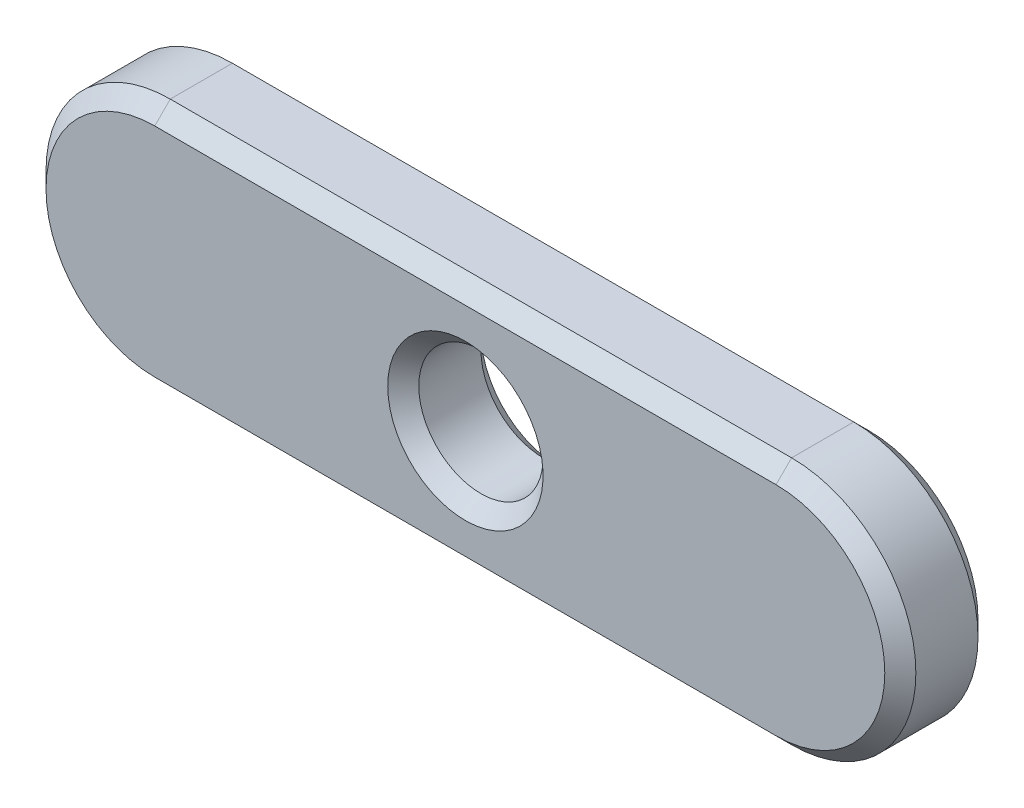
from build123d import *

# Parameters (mm, degrees)
BASE_EXTRUSION_DEPTH    = 3
ESQUISSE2_R             = 2
ENL_V_MAT_EXTRU_1_DEPTH = 3
CHANFREIN1_SIZE         = 0.5


with BuildPart() as part:
    # Esquisse1 → Base-Extrusion (new body)
    with BuildSketch(Plane.XY):
        with BuildLine():
            Line((-10, 4), (10, 4))
            ThreePointArc((10, 4), (14, 0), (10, -4))
            Line((10, -4), (-10, -4))
            ThreePointArc((-10, -4), (-14, 0), (-10, 4))
        make_face()
    extrude(amount=BASE_EXTRUSION_DEPTH)

    # Esquisse2 → Enl_v. mat.-Extru.1 (cut)
    with BuildSketch(Plane.XY.offset(3)):
        with Locations(Location((0, 0, 0), (0, 0, 180))):
            Circle(ESQUISSE2_R)
    extrude(amount=-ENL_V_MAT_EXTRU_1_DEPTH, mode=Mode.SUBTRACT)

    # Chanfrein1
    chanfrein1_edges = [part.edges().sort_by_distance(p)[0] for p in [
        (0, -4, 0),
        (0, -4, 3),
        (14, 0, 0),
        (14, 0, 3),
        (-14, 0, 0),
        (-14, 0, 3),
        (0, 4, 0),
        (2, 0, 0),
        (0, 4, 3),
        (2, 0, 3),
    ]]
    chamfer(chanfrein1_edges, length=CHANFREIN1_SIZE)


solid = part.part
